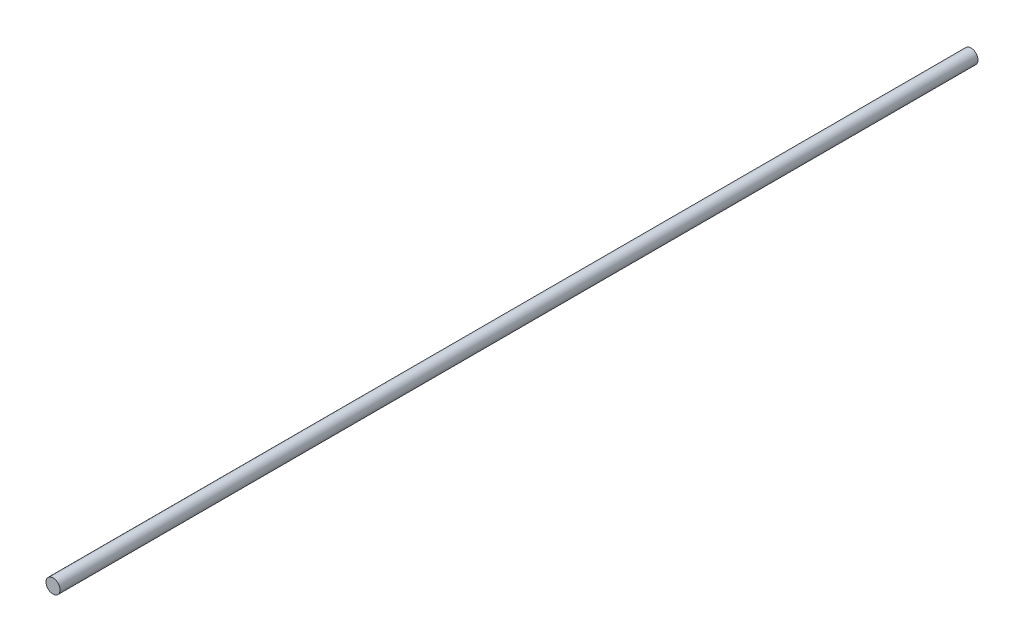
ISO-10303-21;
HEADER;
FILE_DESCRIPTION(('STEP AP214'),'2;1');
FILE_NAME('part.step','',(''),(''),'','','');
FILE_SCHEMA(('AUTOMOTIVE_DESIGN { 1 0 10303 214 1 1 1 1 }'));
ENDSEC;
DATA;
#1=APPLICATION_CONTEXT('core data for automotive mechanical design processes');
#2=APPLICATION_PROTOCOL_DEFINITION('international standard','automotive_design',2000,#1);
#3=PRODUCT_CONTEXT('',#1,'mechanical');
#4=PRODUCT('Part','Part','',(#3));
#5=PRODUCT_RELATED_PRODUCT_CATEGORY('part','',(#4));
#6=PRODUCT_DEFINITION_FORMATION('','',#4);
#7=PRODUCT_DEFINITION_CONTEXT('part definition',#1,'design');
#8=PRODUCT_DEFINITION('design','',#6,#7);
#9=PRODUCT_DEFINITION_SHAPE('','',#8);
#10=(LENGTH_UNIT() NAMED_UNIT(*) SI_UNIT(.MILLI.,.METRE.));
#11=(NAMED_UNIT(*) PLANE_ANGLE_UNIT() SI_UNIT($,.RADIAN.));
#12=(NAMED_UNIT(*) SI_UNIT($,.STERADIAN.) SOLID_ANGLE_UNIT());
#13=UNCERTAINTY_MEASURE_WITH_UNIT(LENGTH_MEASURE(1.E-05),#10,'distance_accuracy_value','');
#14=(GEOMETRIC_REPRESENTATION_CONTEXT(3) GLOBAL_UNCERTAINTY_ASSIGNED_CONTEXT((#13)) GLOBAL_UNIT_ASSIGNED_CONTEXT((#10,
#11,#12)) REPRESENTATION_CONTEXT('',''));
#15=CARTESIAN_POINT('',(0.,0.,0.));
#16=DIRECTION('',(0.,0.,1.));
#17=DIRECTION('',(1.,0.,0.));
#18=AXIS2_PLACEMENT_3D('',#15,#16,#17);
#19=CARTESIAN_POINT('',(0.,0.,182.88));
#20=DIRECTION('',(0.,0.,-1.));
#21=DIRECTION('',(-1.,0.,0.));
#22=AXIS2_PLACEMENT_3D('',#19,#20,#21);
#23=CYLINDRICAL_SURFACE('',#22,1.4);
#24=CARTESIAN_POINT('',(0.,0.,182.88));
#25=DIRECTION('',(0.,0.,1.));
#26=DIRECTION('',(1.,0.,0.));
#27=AXIS2_PLACEMENT_3D('',#24,#25,#26);
#28=CIRCLE('',#27,1.4);
#29=CARTESIAN_POINT('',(1.4,0.,182.88));
#30=VERTEX_POINT('',#29);
#31=EDGE_CURVE('E10',#30,#30,#28,.T.);
#32=ORIENTED_EDGE('',*,*,#31,.F.);
#33=EDGE_LOOP('',(#32));
#34=FACE_BOUND('',#33,.T.);
#35=CARTESIAN_POINT('',(0.,0.,0.));
#36=DIRECTION('',(0.,0.,1.));
#37=DIRECTION('',(1.,0.,0.));
#38=AXIS2_PLACEMENT_3D('',#35,#36,#37);
#39=CIRCLE('',#38,1.4);
#40=CARTESIAN_POINT('',(1.4,0.,0.));
#41=VERTEX_POINT('',#40);
#42=EDGE_CURVE('E46',#41,#41,#39,.T.);
#43=ORIENTED_EDGE('',*,*,#42,.T.);
#44=EDGE_LOOP('',(#43));
#45=FACE_BOUND('',#44,.T.);
#46=ADVANCED_FACE('F43',(#34,#45),#23,.T.);
#47=CARTESIAN_POINT('',(0.,0.,182.88));
#48=DIRECTION('',(0.,0.,1.));
#49=DIRECTION('',(1.,0.,0.));
#50=AXIS2_PLACEMENT_3D('',#47,#48,#49);
#51=PLANE('',#50);
#52=ORIENTED_EDGE('',*,*,#31,.T.);
#53=EDGE_LOOP('',(#52));
#54=FACE_BOUND('',#53,.T.);
#55=ADVANCED_FACE('F58',(#54),#51,.T.);
#56=CARTESIAN_POINT('',(0.,0.,0.));
#57=DIRECTION('',(0.,0.,1.));
#58=DIRECTION('',(1.,0.,0.));
#59=AXIS2_PLACEMENT_3D('',#56,#57,#58);
#60=PLANE('',#59);
#61=ORIENTED_EDGE('',*,*,#42,.F.);
#62=EDGE_LOOP('',(#61));
#63=FACE_BOUND('',#62,.T.);
#64=ADVANCED_FACE('F59',(#63),#60,.F.);
#65=CLOSED_SHELL('',(#46,#55,#64));
#66=MANIFOLD_SOLID_BREP('B2',#65);
#67=ADVANCED_BREP_SHAPE_REPRESENTATION('',(#18,#66),#14);
#68=SHAPE_DEFINITION_REPRESENTATION(#9,#67);
ENDSEC;
END-ISO-10303-21;
